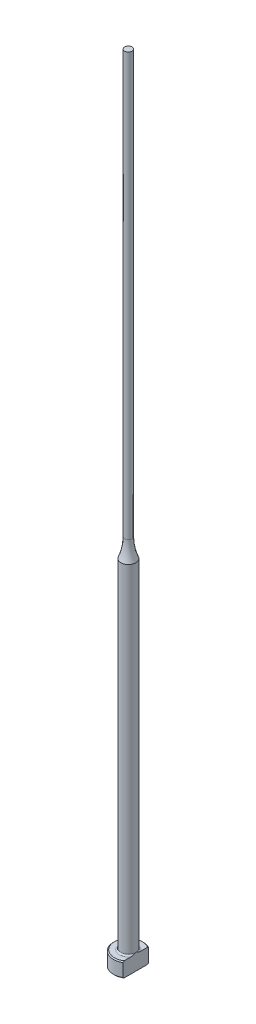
from build123d import *
from build123d.topology import SkipClean

# Parameters (mm, degrees)
CHAMFER1_SIZE = 0.2
FILLET1_R     = 0.3
KEY_DEPTH     = 161.056240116


with BuildPart() as part:
    # Sketch1 → Revolve1 (revolve)
    with BuildSketch(Plane.XY, mode=Mode.PRIVATE) as revolve1_sk:
        with BuildLine():
            Line((0, 0), (-3, 0))
            Line((-3, 0), (-3, 3))
            Line((-3, 3), (-1.5, 3))
            Line((-1.5, 3), (-1.5, 71.200328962))
            ThreePointArc((-1.5, 71.200328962), (-0.939291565, 73.063508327), (-0.75, 75))
            Line((-0.75, 75), (-0.75, 160))
            Line((-0.75, 160), (0, 160))
            Line((0, 160), (0, 0))
        make_face()
    revolve(revolve1_sk.sketch.rotate(Axis((0, 259.958771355, 0), (0, -1, 0)), 270), axis=Axis((0, 259.958771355, 0), (0, -1, 0)))

    # Chamfer1
    chamfer1_edges = [part.edges().sort_by_distance(p)[0] for p in [
        (0, 0, -3),
        (0, 3, -3),
    ]]
    chamfer(chamfer1_edges, length=CHAMFER1_SIZE)

    # Fillet1
    fillet1_edges = [part.edges().sort_by_distance(p)[0] for p in [
        (0, 3, -1.5),
    ]]
    fillet(fillet1_edges, radius=FILLET1_R)

    # Sketch2 → KEY (cut, through all)
    with SkipClean():  # the faces are left unmerged after this step: merging them gives an invalid solid
        with BuildSketch(Plane(origin=(0, 0, 0), x_dir=(1, 0, 0), z_dir=(0, 1, 0))):
            with BuildLine():
                Line((1.5, 2.598076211), (1.5, -2.598076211))
                ThreePointArc((1.5, -2.598076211), (3, 0), (1.5, 2.598076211))
            make_face()
        extrude(amount=KEY_DEPTH, mode=Mode.SUBTRACT)


solid = part.part
